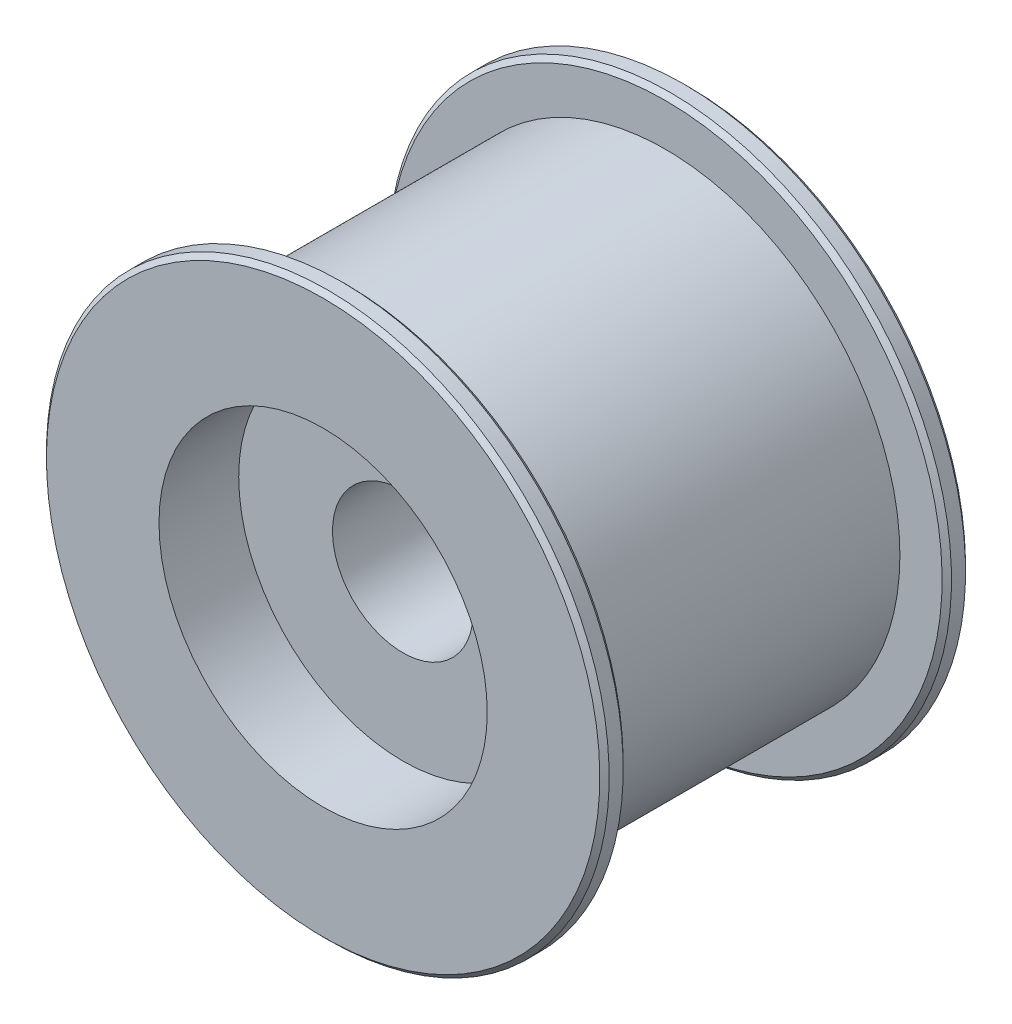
ISO-10303-21;
HEADER;
FILE_DESCRIPTION(('STEP AP214'),'2;1');
FILE_NAME('part.step','',(''),(''),'','','');
FILE_SCHEMA(('AUTOMOTIVE_DESIGN { 1 0 10303 214 1 1 1 1 }'));
ENDSEC;
DATA;
#1=APPLICATION_CONTEXT('core data for automotive mechanical design processes');
#2=APPLICATION_PROTOCOL_DEFINITION('international standard','automotive_design',2000,#1);
#3=PRODUCT_CONTEXT('',#1,'mechanical');
#4=PRODUCT('Part','Part','',(#3));
#5=PRODUCT_RELATED_PRODUCT_CATEGORY('part','',(#4));
#6=PRODUCT_DEFINITION_FORMATION('','',#4);
#7=PRODUCT_DEFINITION_CONTEXT('part definition',#1,'design');
#8=PRODUCT_DEFINITION('design','',#6,#7);
#9=PRODUCT_DEFINITION_SHAPE('','',#8);
#10=(LENGTH_UNIT() NAMED_UNIT(*) SI_UNIT(.MILLI.,.METRE.));
#11=(NAMED_UNIT(*) PLANE_ANGLE_UNIT() SI_UNIT($,.RADIAN.));
#12=(NAMED_UNIT(*) SI_UNIT($,.STERADIAN.) SOLID_ANGLE_UNIT());
#13=UNCERTAINTY_MEASURE_WITH_UNIT(LENGTH_MEASURE(1.E-05),#10,'distance_accuracy_value','');
#14=(GEOMETRIC_REPRESENTATION_CONTEXT(3) GLOBAL_UNCERTAINTY_ASSIGNED_CONTEXT((#13)) GLOBAL_UNIT_ASSIGNED_CONTEXT((#10,
#11,#12)) REPRESENTATION_CONTEXT('',''));
#15=CARTESIAN_POINT('',(0.,0.,0.));
#16=DIRECTION('',(0.,0.,1.));
#17=DIRECTION('',(1.,0.,0.));
#18=AXIS2_PLACEMENT_3D('',#15,#16,#17);
#19=CARTESIAN_POINT('',(0.,-14.999999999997,11.));
#20=DIRECTION('',(0.,0.,-1.));
#21=DIRECTION('',(0.,-1.,0.));
#22=AXIS2_PLACEMENT_3D('',#19,#20,#21);
#23=PLANE('',#22);
#24=CARTESIAN_POINT('',(0.,0.,11.));
#25=DIRECTION('',(0.,0.,1.));
#26=DIRECTION('',(0.,1.,0.));
#27=AXIS2_PLACEMENT_3D('',#24,#25,#26);
#28=CIRCLE('',#27,7.49999999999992);
#29=CARTESIAN_POINT('',(0.,7.49999999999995,11.));
#30=VERTEX_POINT('',#29);
#31=EDGE_CURVE('E8',#30,#30,#28,.T.);
#32=ORIENTED_EDGE('',*,*,#31,.F.);
#33=EDGE_LOOP('',(#32));
#34=FACE_BOUND('',#33,.T.);
#35=CARTESIAN_POINT('',(0.,0.,11.));
#36=DIRECTION('',(0.,0.,1.));
#37=DIRECTION('',(1.,0.,0.));
#38=AXIS2_PLACEMENT_3D('',#35,#36,#37);
#39=CIRCLE('',#38,17.499999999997);
#40=CARTESIAN_POINT('',(17.499999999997,0.,11.));
#41=VERTEX_POINT('',#40);
#42=EDGE_CURVE('E52',#41,#41,#39,.T.);
#43=ORIENTED_EDGE('',*,*,#42,.T.);
#44=EDGE_LOOP('',(#43));
#45=FACE_BOUND('',#44,.T.);
#46=ADVANCED_FACE('F12',(#34,#45),#23,.F.);
#47=CARTESIAN_POINT('',(0.,0.,22.));
#48=DIRECTION('',(0.,0.,1.));
#49=DIRECTION('',(0.,1.,0.));
#50=AXIS2_PLACEMENT_3D('',#47,#48,#49);
#51=CYLINDRICAL_SURFACE('',#50,7.49999999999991);
#52=CARTESIAN_POINT('',(0.,0.,-11.));
#53=DIRECTION('',(0.,0.,1.));
#54=DIRECTION('',(0.,1.,0.));
#55=AXIS2_PLACEMENT_3D('',#52,#53,#54);
#56=CIRCLE('',#55,7.4999999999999);
#57=CARTESIAN_POINT('',(0.,7.4999999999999,-11.));
#58=VERTEX_POINT('',#57);
#59=EDGE_CURVE('E18',#58,#58,#56,.T.);
#60=ORIENTED_EDGE('',*,*,#59,.F.);
#61=EDGE_LOOP('',(#60));
#62=FACE_BOUND('',#61,.T.);
#63=ORIENTED_EDGE('',*,*,#31,.T.);
#64=EDGE_LOOP('',(#63));
#65=FACE_BOUND('',#64,.T.);
#66=ADVANCED_FACE('F89',(#62,#65),#51,.F.);
#67=CARTESIAN_POINT('',(0.,-14.,-11.));
#68=DIRECTION('',(0.,0.,1.));
#69=DIRECTION('',(0.,1.,0.));
#70=AXIS2_PLACEMENT_3D('',#67,#68,#69);
#71=PLANE('',#70);
#72=CARTESIAN_POINT('',(0.,0.,-11.));
#73=DIRECTION('',(0.,0.,1.));
#74=DIRECTION('',(0.,1.,0.));
#75=AXIS2_PLACEMENT_3D('',#72,#73,#74);
#76=CIRCLE('',#75,14.);
#77=CARTESIAN_POINT('',(0.,14.,-11.));
#78=VERTEX_POINT('',#77);
#79=EDGE_CURVE('E22',#78,#78,#76,.T.);
#80=ORIENTED_EDGE('',*,*,#79,.F.);
#81=EDGE_LOOP('',(#80));
#82=FACE_BOUND('',#81,.T.);
#83=ORIENTED_EDGE('',*,*,#59,.T.);
#84=EDGE_LOOP('',(#83));
#85=FACE_BOUND('',#84,.T.);
#86=ADVANCED_FACE('F84',(#82,#85),#71,.F.);
#87=CARTESIAN_POINT('',(0.,0.,22.));
#88=DIRECTION('',(0.,0.,1.));
#89=DIRECTION('',(0.,1.,0.));
#90=AXIS2_PLACEMENT_3D('',#87,#88,#89);
#91=CYLINDRICAL_SURFACE('',#90,14.);
#92=ORIENTED_EDGE('',*,*,#79,.T.);
#93=EDGE_LOOP('',(#92));
#94=FACE_BOUND('',#93,.T.);
#95=CARTESIAN_POINT('',(0.,0.,-19.5));
#96=DIRECTION('',(0.,0.,-1.));
#97=DIRECTION('',(-1.,0.,0.));
#98=AXIS2_PLACEMENT_3D('',#95,#96,#97);
#99=CIRCLE('',#98,14.);
#100=CARTESIAN_POINT('',(-14.,0.,-19.5));
#101=VERTEX_POINT('',#100);
#102=EDGE_CURVE('E64',#101,#101,#99,.T.);
#103=ORIENTED_EDGE('',*,*,#102,.T.);
#104=EDGE_LOOP('',(#103));
#105=FACE_BOUND('',#104,.T.);
#106=ADVANCED_FACE('F68',(#94,#105),#91,.F.);
#107=CARTESIAN_POINT('',(0.,-29.5,-19.5));
#108=DIRECTION('',(0.,0.,1.));
#109=DIRECTION('',(0.,1.,0.));
#110=AXIS2_PLACEMENT_3D('',#107,#108,#109);
#111=PLANE('',#110);
#112=CARTESIAN_POINT('',(0.,0.,-19.5));
#113=DIRECTION('',(0.,0.,1.));
#114=DIRECTION('',(0.,1.,0.));
#115=AXIS2_PLACEMENT_3D('',#112,#113,#114);
#116=CIRCLE('',#115,29.5);
#117=CARTESIAN_POINT('',(0.,29.5,-19.5));
#118=VERTEX_POINT('',#117);
#119=EDGE_CURVE('E26',#118,#118,#116,.T.);
#120=ORIENTED_EDGE('',*,*,#119,.F.);
#121=EDGE_LOOP('',(#120));
#122=FACE_BOUND('',#121,.T.);
#123=ORIENTED_EDGE('',*,*,#102,.F.);
#124=EDGE_LOOP('',(#123));
#125=FACE_BOUND('',#124,.T.);
#126=ADVANCED_FACE('F70',(#122,#125),#111,.F.);
#127=CARTESIAN_POINT('',(0.,0.,-19.5));
#128=DIRECTION('',(0.,0.,1.));
#129=DIRECTION('',(0.,1.,0.));
#130=AXIS2_PLACEMENT_3D('',#127,#128,#129);
#131=CONICAL_SURFACE('',#130,29.5,0.785398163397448);
#132=CARTESIAN_POINT('',(0.,0.,-19.));
#133=DIRECTION('',(0.,0.,1.));
#134=DIRECTION('',(0.,1.,0.));
#135=AXIS2_PLACEMENT_3D('',#132,#133,#134);
#136=CIRCLE('',#135,30.);
#137=CARTESIAN_POINT('',(0.,30.,-19.));
#138=VERTEX_POINT('',#137);
#139=EDGE_CURVE('E31',#138,#138,#136,.T.);
#140=ORIENTED_EDGE('',*,*,#139,.F.);
#141=EDGE_LOOP('',(#140));
#142=FACE_BOUND('',#141,.T.);
#143=ORIENTED_EDGE('',*,*,#119,.T.);
#144=EDGE_LOOP('',(#143));
#145=FACE_BOUND('',#144,.T.);
#146=ADVANCED_FACE('F72',(#142,#145),#131,.T.);
#147=CARTESIAN_POINT('',(0.,0.,22.));
#148=DIRECTION('',(0.,0.,1.));
#149=DIRECTION('',(0.,1.,0.));
#150=AXIS2_PLACEMENT_3D('',#147,#148,#149);
#151=CYLINDRICAL_SURFACE('',#150,30.);
#152=CARTESIAN_POINT('',(0.,0.,-17.5));
#153=DIRECTION('',(0.,0.,1.));
#154=DIRECTION('',(0.,1.,0.));
#155=AXIS2_PLACEMENT_3D('',#152,#153,#154);
#156=CIRCLE('',#155,30.);
#157=CARTESIAN_POINT('',(0.,30.,-17.5));
#158=VERTEX_POINT('',#157);
#159=EDGE_CURVE('E34',#158,#158,#156,.T.);
#160=ORIENTED_EDGE('',*,*,#159,.F.);
#161=EDGE_LOOP('',(#160));
#162=FACE_BOUND('',#161,.T.);
#163=ORIENTED_EDGE('',*,*,#139,.T.);
#164=EDGE_LOOP('',(#163));
#165=FACE_BOUND('',#164,.T.);
#166=ADVANCED_FACE('F81',(#162,#165),#151,.T.);
#167=CARTESIAN_POINT('',(0.,0.,-17.5));
#168=DIRECTION('',(0.,0.,-1.));
#169=DIRECTION('',(0.,-1.,0.));
#170=AXIS2_PLACEMENT_3D('',#167,#168,#169);
#171=CONICAL_SURFACE('',#170,30.,0.785398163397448);
#172=CARTESIAN_POINT('',(0.,0.,-17.));
#173=DIRECTION('',(0.,0.,1.));
#174=DIRECTION('',(0.,1.,0.));
#175=AXIS2_PLACEMENT_3D('',#172,#173,#174);
#176=CIRCLE('',#175,29.5);
#177=CARTESIAN_POINT('',(0.,29.5,-17.));
#178=VERTEX_POINT('',#177);
#179=EDGE_CURVE('E37',#178,#178,#176,.T.);
#180=ORIENTED_EDGE('',*,*,#179,.F.);
#181=EDGE_LOOP('',(#180));
#182=FACE_BOUND('',#181,.T.);
#183=ORIENTED_EDGE('',*,*,#159,.T.);
#184=EDGE_LOOP('',(#183));
#185=FACE_BOUND('',#184,.T.);
#186=ADVANCED_FACE('F136',(#182,#185),#171,.T.);
#187=CARTESIAN_POINT('',(0.,-25.4,-17.));
#188=DIRECTION('',(0.,0.,-1.));
#189=DIRECTION('',(0.,-1.,0.));
#190=AXIS2_PLACEMENT_3D('',#187,#188,#189);
#191=PLANE('',#190);
#192=CARTESIAN_POINT('',(0.,0.,-17.));
#193=DIRECTION('',(0.,0.,1.));
#194=DIRECTION('',(1.,0.,0.));
#195=AXIS2_PLACEMENT_3D('',#192,#193,#194);
#196=CIRCLE('',#195,25.);
#197=CARTESIAN_POINT('',(25.,0.,-17.));
#198=VERTEX_POINT('',#197);
#199=EDGE_CURVE('E58',#198,#198,#196,.T.);
#200=ORIENTED_EDGE('',*,*,#199,.F.);
#201=EDGE_LOOP('',(#200));
#202=FACE_BOUND('',#201,.T.);
#203=ORIENTED_EDGE('',*,*,#179,.T.);
#204=EDGE_LOOP('',(#203));
#205=FACE_BOUND('',#204,.T.);
#206=ADVANCED_FACE('F132',(#202,#205),#191,.F.);
#207=CARTESIAN_POINT('',(0.,0.,22.));
#208=DIRECTION('',(0.,0.,1.));
#209=DIRECTION('',(0.,1.,0.));
#210=AXIS2_PLACEMENT_3D('',#207,#208,#209);
#211=CYLINDRICAL_SURFACE('',#210,25.);
#212=CARTESIAN_POINT('',(0.,0.,17.));
#213=DIRECTION('',(0.,0.,1.));
#214=DIRECTION('',(1.,0.,0.));
#215=AXIS2_PLACEMENT_3D('',#212,#213,#214);
#216=CIRCLE('',#215,25.);
#217=CARTESIAN_POINT('',(25.,0.,17.));
#218=VERTEX_POINT('',#217);
#219=EDGE_CURVE('E55',#218,#218,#216,.T.);
#220=ORIENTED_EDGE('',*,*,#219,.F.);
#221=EDGE_LOOP('',(#220));
#222=FACE_BOUND('',#221,.T.);
#223=ORIENTED_EDGE('',*,*,#199,.T.);
#224=EDGE_LOOP('',(#223));
#225=FACE_BOUND('',#224,.T.);
#226=ADVANCED_FACE('F128',(#222,#225),#211,.T.);
#227=CARTESIAN_POINT('',(0.,-25.4,17.));
#228=DIRECTION('',(0.,0.,1.));
#229=DIRECTION('',(0.,1.,0.));
#230=AXIS2_PLACEMENT_3D('',#227,#228,#229);
#231=PLANE('',#230);
#232=CARTESIAN_POINT('',(0.,0.,17.));
#233=DIRECTION('',(0.,0.,1.));
#234=DIRECTION('',(0.,1.,0.));
#235=AXIS2_PLACEMENT_3D('',#232,#233,#234);
#236=CIRCLE('',#235,29.5);
#237=CARTESIAN_POINT('',(0.,29.5,17.));
#238=VERTEX_POINT('',#237);
#239=EDGE_CURVE('E40',#238,#238,#236,.T.);
#240=ORIENTED_EDGE('',*,*,#239,.F.);
#241=EDGE_LOOP('',(#240));
#242=FACE_BOUND('',#241,.T.);
#243=ORIENTED_EDGE('',*,*,#219,.T.);
#244=EDGE_LOOP('',(#243));
#245=FACE_BOUND('',#244,.T.);
#246=ADVANCED_FACE('F124',(#242,#245),#231,.F.);
#247=CARTESIAN_POINT('',(0.,0.,17.));
#248=DIRECTION('',(0.,0.,1.));
#249=DIRECTION('',(0.,1.,0.));
#250=AXIS2_PLACEMENT_3D('',#247,#248,#249);
#251=CONICAL_SURFACE('',#250,29.5,0.785398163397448);
#252=CARTESIAN_POINT('',(0.,0.,17.5));
#253=DIRECTION('',(0.,0.,1.));
#254=DIRECTION('',(0.,1.,0.));
#255=AXIS2_PLACEMENT_3D('',#252,#253,#254);
#256=CIRCLE('',#255,30.);
#257=CARTESIAN_POINT('',(0.,30.,17.5));
#258=VERTEX_POINT('',#257);
#259=EDGE_CURVE('E43',#258,#258,#256,.T.);
#260=ORIENTED_EDGE('',*,*,#259,.F.);
#261=EDGE_LOOP('',(#260));
#262=FACE_BOUND('',#261,.T.);
#263=ORIENTED_EDGE('',*,*,#239,.T.);
#264=EDGE_LOOP('',(#263));
#265=FACE_BOUND('',#264,.T.);
#266=ADVANCED_FACE('F120',(#262,#265),#251,.T.);
#267=CARTESIAN_POINT('',(0.,0.,22.));
#268=DIRECTION('',(0.,0.,1.));
#269=DIRECTION('',(0.,1.,0.));
#270=AXIS2_PLACEMENT_3D('',#267,#268,#269);
#271=CYLINDRICAL_SURFACE('',#270,30.);
#272=CARTESIAN_POINT('',(0.,0.,19.));
#273=DIRECTION('',(0.,0.,1.));
#274=DIRECTION('',(0.,1.,0.));
#275=AXIS2_PLACEMENT_3D('',#272,#273,#274);
#276=CIRCLE('',#275,30.);
#277=CARTESIAN_POINT('',(0.,30.,19.));
#278=VERTEX_POINT('',#277);
#279=EDGE_CURVE('E46',#278,#278,#276,.T.);
#280=ORIENTED_EDGE('',*,*,#279,.F.);
#281=EDGE_LOOP('',(#280));
#282=FACE_BOUND('',#281,.T.);
#283=ORIENTED_EDGE('',*,*,#259,.T.);
#284=EDGE_LOOP('',(#283));
#285=FACE_BOUND('',#284,.T.);
#286=ADVANCED_FACE('F114',(#282,#285),#271,.T.);
#287=CARTESIAN_POINT('',(0.,0.,19.));
#288=DIRECTION('',(0.,0.,-1.));
#289=DIRECTION('',(0.,-1.,0.));
#290=AXIS2_PLACEMENT_3D('',#287,#288,#289);
#291=CONICAL_SURFACE('',#290,30.,0.785398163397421);
#292=CARTESIAN_POINT('',(0.,0.,19.5));
#293=DIRECTION('',(0.,0.,1.));
#294=DIRECTION('',(0.,1.,0.));
#295=AXIS2_PLACEMENT_3D('',#292,#293,#294);
#296=CIRCLE('',#295,29.5);
#297=CARTESIAN_POINT('',(0.,29.5,19.5));
#298=VERTEX_POINT('',#297);
#299=EDGE_CURVE('E49',#298,#298,#296,.T.);
#300=ORIENTED_EDGE('',*,*,#299,.F.);
#301=EDGE_LOOP('',(#300));
#302=FACE_BOUND('',#301,.T.);
#303=ORIENTED_EDGE('',*,*,#279,.T.);
#304=EDGE_LOOP('',(#303));
#305=FACE_BOUND('',#304,.T.);
#306=ADVANCED_FACE('F107',(#302,#305),#291,.T.);
#307=CARTESIAN_POINT('',(0.,-29.5,19.5));
#308=DIRECTION('',(0.,0.,-1.));
#309=DIRECTION('',(0.,-1.,0.));
#310=AXIS2_PLACEMENT_3D('',#307,#308,#309);
#311=PLANE('',#310);
#312=ORIENTED_EDGE('',*,*,#299,.T.);
#313=EDGE_LOOP('',(#312));
#314=FACE_BOUND('',#313,.T.);
#315=CARTESIAN_POINT('',(0.,0.,19.5));
#316=DIRECTION('',(0.,0.,-1.));
#317=DIRECTION('',(-1.,0.,0.));
#318=AXIS2_PLACEMENT_3D('',#315,#316,#317);
#319=CIRCLE('',#318,17.499999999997);
#320=CARTESIAN_POINT('',(-17.499999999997,0.,19.5));
#321=VERTEX_POINT('',#320);
#322=EDGE_CURVE('E61',#321,#321,#319,.T.);
#323=ORIENTED_EDGE('',*,*,#322,.T.);
#324=EDGE_LOOP('',(#323));
#325=FACE_BOUND('',#324,.T.);
#326=ADVANCED_FACE('F102',(#314,#325),#311,.F.);
#327=CARTESIAN_POINT('',(0.,0.,22.));
#328=DIRECTION('',(0.,0.,1.));
#329=DIRECTION('',(0.,1.,0.));
#330=AXIS2_PLACEMENT_3D('',#327,#328,#329);
#331=CYLINDRICAL_SURFACE('',#330,17.499999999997);
#332=ORIENTED_EDGE('',*,*,#42,.F.);
#333=EDGE_LOOP('',(#332));
#334=FACE_BOUND('',#333,.T.);
#335=ORIENTED_EDGE('',*,*,#322,.F.);
#336=EDGE_LOOP('',(#335));
#337=FACE_BOUND('',#336,.T.);
#338=ADVANCED_FACE('F99',(#334,#337),#331,.F.);
#339=CLOSED_SHELL('',(#46,#66,#86,#106,#126,#146,#166,#186,#206,#226,#246,#266,#286,#306,#326,#338));
#340=MANIFOLD_SOLID_BREP('B1',#339);
#341=ADVANCED_BREP_SHAPE_REPRESENTATION('',(#18,#340),#14);
#342=SHAPE_DEFINITION_REPRESENTATION(#9,#341);
ENDSEC;
END-ISO-10303-21;
